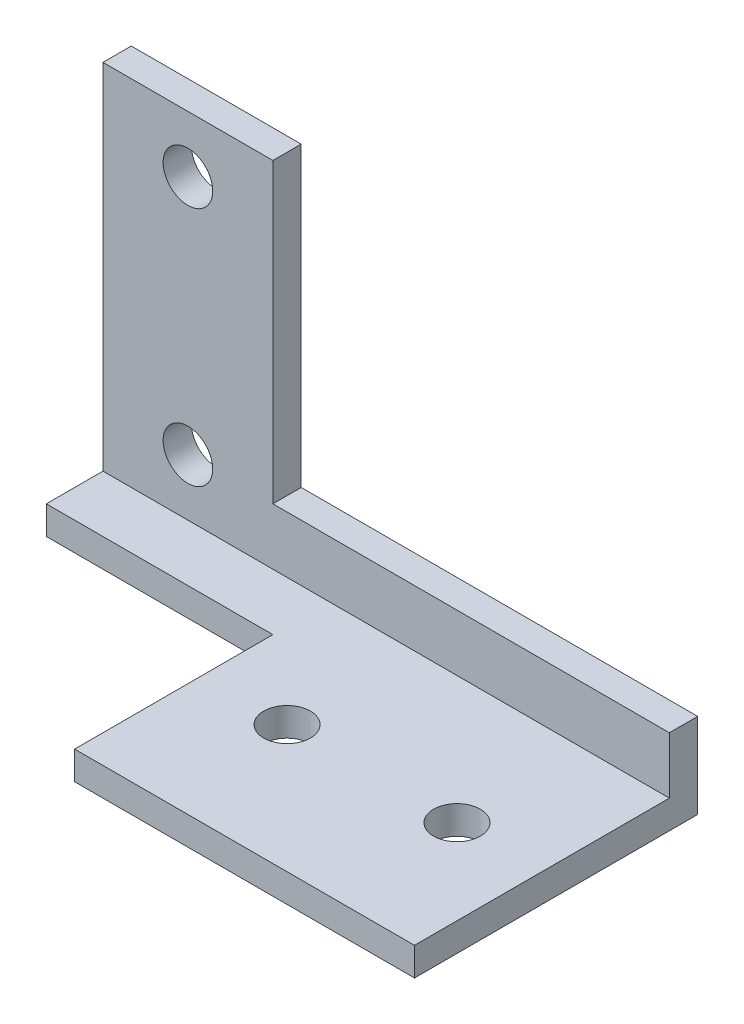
from build123d import *

# Parameters (mm, degrees)
EXTRUDE1_DEPTH    = 40
SKETCH2_W         = 28
SKETCH2_H         = 21
EXTRUDE2_DEPTH    = 40
SKETCH3_W         = 16
SKETCH3_H         = 14
EXTRUDE3_DEPTH    = 40
SKETCH4_R         = 1.75
EXTRUDE4_DEPTH    = 40
M4_TAPPED_HOLE1_D = 3.3


with BuildPart() as part:
    # Sketch1 → Extrude1 (new body)
    with BuildSketch(Plane(origin=(0, 0, 0), x_dir=(0, 0, -1), z_dir=(1, 0, 0))):
        Polygon((0, 27), (0, 0), (-20, 0), (-20, 2), (-2, 2), (-2, 27), align=None)
    extrude(amount=EXTRUDE1_DEPTH)

    # Sketch2 → Extrude2 (cut)
    with BuildSketch(Plane.XY.offset(2)):
        with Locations((26, 16.5)):
            Rectangle(SKETCH2_W, SKETCH2_H)
    extrude(amount=-EXTRUDE2_DEPTH, mode=Mode.SUBTRACT)

    # Sketch3 → Extrude3 (cut)
    with BuildSketch(Plane(origin=(0, 2, 0), x_dir=(1, 0, 0), z_dir=(0, 1, 0))):
        with Locations((8, -13)):
            Rectangle(SKETCH3_W, SKETCH3_H)
    extrude(amount=-EXTRUDE3_DEPTH, mode=Mode.SUBTRACT)

    # Sketch4 → Extrude4 (cut)
    with BuildSketch(Plane.XY.offset(2)):
        with Locations((6, 23)):
            Circle(SKETCH4_R)
        with Locations((6, 6)):
            Circle(SKETCH4_R)
    extrude(amount=-EXTRUDE4_DEPTH, mode=Mode.SUBTRACT)

    # M4 Tapped Hole1 (through all)
    with Locations(Plane(origin=(34, 2, 11), x_dir=(0, 0, 1), z_dir=(0, 1, 0))):
        with Locations((0, 0), (0, -12)):
            Hole(M4_TAPPED_HOLE1_D / 2)


solid = part.part
